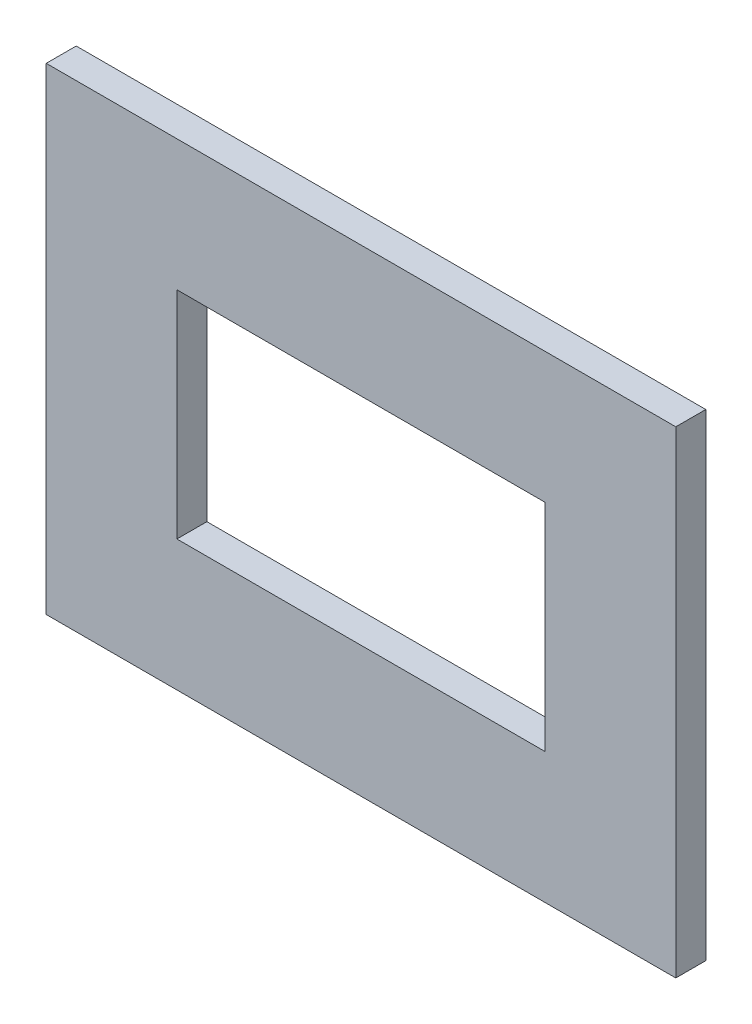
from build123d import *

# Parameters (mm, degrees)
SKETCH1_W           = 1407.485243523
SKETCH1_H           = 1128.959139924
SKETCH1_W_2         = 184.15
SKETCH1_H_2         = 107.95
BOSS_EXTRUDE1_DEPTH = 15
SKETCH2_W           = 1634.850849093
SKETCH2_H           = 1414.029762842
SKETCH2_W_2         = 676.784885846
SKETCH2_H_2         = 461.196152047
CUT_EXTRUDE1_DEPTH  = 1080.206832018
SKETCH3_W           = 965.208411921
SKETCH3_H           = 712.31537823
CUT_EXTRUDE2_DEPTH  = 25
SKETCH4_W           = 314.878157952
SKETCH4_H           = 238.75
CUT_EXTRUDE3_DEPTH  = 528.47496226


with BuildPart() as part:
    # Sketch1 → Boss-Extrude1 (new body)
    with BuildSketch(Plane.XY):
        with Locations((64.619518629, -193.202426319)):
            Rectangle(SKETCH1_W, SKETCH1_H)
        Rectangle(SKETCH1_W_2, SKETCH1_H_2, mode=Mode.SUBTRACT)
    extrude(amount=BOSS_EXTRUDE1_DEPTH)

    # Sketch2 → Cut-Extrude1 (cut, through all)
    with BuildSketch(Plane(origin=(0, 0, 0), x_dir=(-1, 0, 0), z_dir=(0, 0, -1))):
        with Locations((-17.147082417, -252.403097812)):
            Rectangle(SKETCH2_W, SKETCH2_H)
        with Locations((-145.408722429, -66.833058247)):
            Rectangle(SKETCH2_W_2, SKETCH2_H_2, mode=Mode.SUBTRACT)
    extrude(amount=-CUT_EXTRUDE1_DEPTH, mode=Mode.SUBTRACT)

    # Sketch3 → Cut-Extrude2 (cut)
    with BuildSketch(Plane(origin=(0, 0, 0), x_dir=(-1, 0, 0), z_dir=(0, 0, -1))):
        with Locations((-179.127793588, -98.505947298)):
            Rectangle(SKETCH3_W, SKETCH3_H)
        Polygon((192.983720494, 163.765017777), (-435.361408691, 114.674977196), (-435.361408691, -297.43113427), (192.983720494, -248.341093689), align=None, mode=Mode.SUBTRACT)
    extrude(amount=-CUT_EXTRUDE2_DEPTH, mode=Mode.SUBTRACT)

    # Sketch4 → Cut-Extrude3 (cut, through all)
    with BuildSketch(Plane(origin=(0, 0, 0), x_dir=(-1, 0, 0), z_dir=(0, 0, -1))):
        Polygon((-435.361408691, 114.674977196), (-435.361408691, -297.43113427), (192.983720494, -248.341093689), (192.983720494, 163.765017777), align=None)
        Rectangle(SKETCH4_W, SKETCH4_H, mode=Mode.SUBTRACT)
    extrude(amount=-CUT_EXTRUDE3_DEPTH, mode=Mode.SUBTRACT)


solid = part.part
